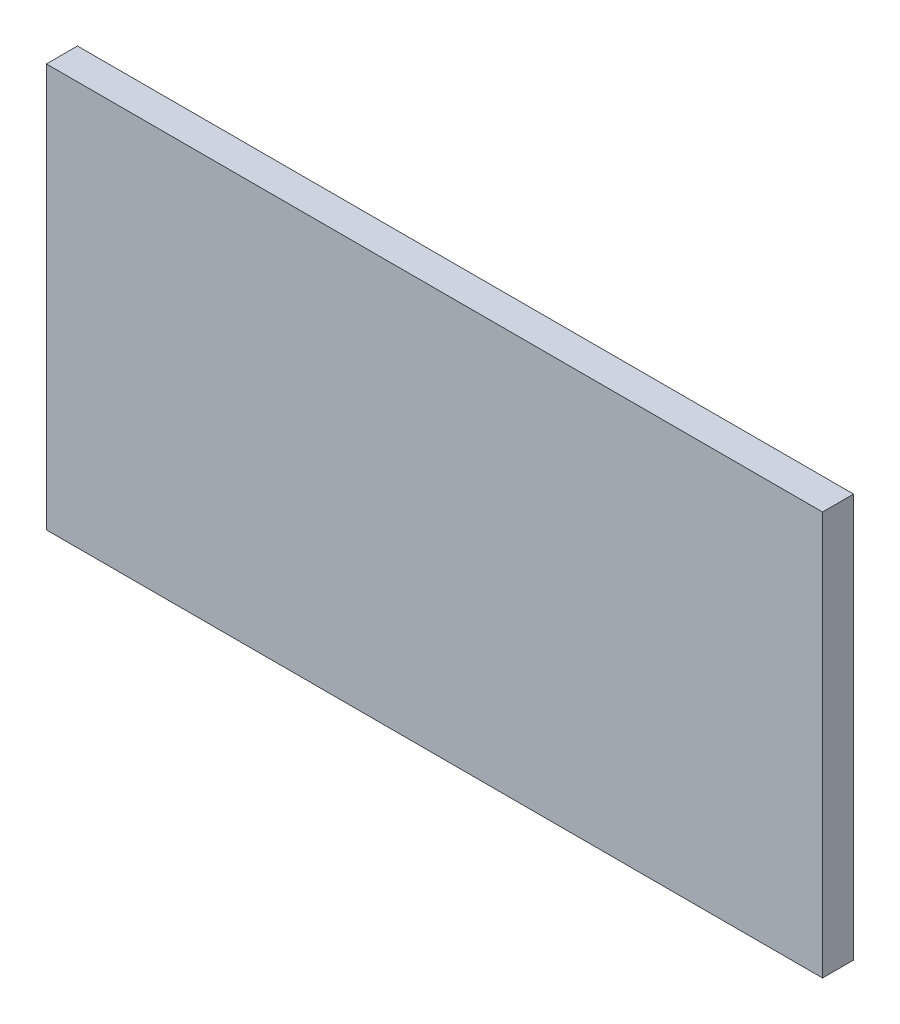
ISO-10303-21;
HEADER;
FILE_DESCRIPTION(('STEP AP214'),'2;1');
FILE_NAME('part.step','',(''),(''),'','','');
FILE_SCHEMA(('AUTOMOTIVE_DESIGN { 1 0 10303 214 1 1 1 1 }'));
ENDSEC;
DATA;
#1=APPLICATION_CONTEXT('core data for automotive mechanical design processes');
#2=APPLICATION_PROTOCOL_DEFINITION('international standard','automotive_design',2000,#1);
#3=PRODUCT_CONTEXT('',#1,'mechanical');
#4=PRODUCT('Part','Part','',(#3));
#5=PRODUCT_RELATED_PRODUCT_CATEGORY('part','',(#4));
#6=PRODUCT_DEFINITION_FORMATION('','',#4);
#7=PRODUCT_DEFINITION_CONTEXT('part definition',#1,'design');
#8=PRODUCT_DEFINITION('design','',#6,#7);
#9=PRODUCT_DEFINITION_SHAPE('','',#8);
#10=(LENGTH_UNIT() NAMED_UNIT(*) SI_UNIT(.MILLI.,.METRE.));
#11=(NAMED_UNIT(*) PLANE_ANGLE_UNIT() SI_UNIT($,.RADIAN.));
#12=(NAMED_UNIT(*) SI_UNIT($,.STERADIAN.) SOLID_ANGLE_UNIT());
#13=UNCERTAINTY_MEASURE_WITH_UNIT(LENGTH_MEASURE(1.E-05),#10,'distance_accuracy_value','');
#14=(GEOMETRIC_REPRESENTATION_CONTEXT(3) GLOBAL_UNCERTAINTY_ASSIGNED_CONTEXT((#13)) GLOBAL_UNIT_ASSIGNED_CONTEXT((#10,
#11,#12)) REPRESENTATION_CONTEXT('',''));
#15=CARTESIAN_POINT('',(0.,0.,0.));
#16=DIRECTION('',(0.,0.,1.));
#17=DIRECTION('',(1.,0.,0.));
#18=AXIS2_PLACEMENT_3D('',#15,#16,#17);
#19=CARTESIAN_POINT('',(0.,0.,101.6));
#20=DIRECTION('',(1.,0.,0.));
#21=DIRECTION('',(0.,1.,0.));
#22=AXIS2_PLACEMENT_3D('',#19,#20,#21);
#23=PLANE('',#22);
#24=DIRECTION('',(0.,-1.,0.));
#25=VECTOR('',#24,1.);
#26=CARTESIAN_POINT('',(0.,0.,0.));
#27=LINE('',#26,#25);
#28=CARTESIAN_POINT('',(-4.44089209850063E-13,1320.8,0.));
#29=VERTEX_POINT('',#28);
#30=CARTESIAN_POINT('',(0.,0.,0.));
#31=VERTEX_POINT('',#30);
#32=EDGE_CURVE('E93',#29,#31,#27,.T.);
#33=ORIENTED_EDGE('',*,*,#32,.T.);
#34=DIRECTION('',(0.,0.,-1.));
#35=VECTOR('',#34,1.);
#36=CARTESIAN_POINT('',(0.,0.,101.6));
#37=LINE('',#36,#35);
#38=CARTESIAN_POINT('',(0.,0.,101.6));
#39=VERTEX_POINT('',#38);
#40=EDGE_CURVE('E11',#39,#31,#37,.T.);
#41=ORIENTED_EDGE('',*,*,#40,.F.);
#42=DIRECTION('',(0.,-1.,0.));
#43=VECTOR('',#42,1.);
#44=CARTESIAN_POINT('',(0.,0.,101.6));
#45=LINE('',#44,#43);
#46=CARTESIAN_POINT('',(-4.44089209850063E-13,1320.8,101.6));
#47=VERTEX_POINT('',#46);
#48=EDGE_CURVE('E81',#47,#39,#45,.T.);
#49=ORIENTED_EDGE('',*,*,#48,.F.);
#50=DIRECTION('',(0.,0.,-1.));
#51=VECTOR('',#50,1.);
#52=CARTESIAN_POINT('',(-4.44089209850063E-13,1320.8,101.6));
#53=LINE('',#52,#51);
#54=EDGE_CURVE('E89',#47,#29,#53,.T.);
#55=ORIENTED_EDGE('',*,*,#54,.T.);
#56=EDGE_LOOP('',(#33,#41,#49,#55));
#57=FACE_BOUND('',#56,.T.);
#58=ADVANCED_FACE('F30',(#57),#23,.F.);
#59=CARTESIAN_POINT('',(0.,0.,101.6));
#60=DIRECTION('',(0.,1.,0.));
#61=DIRECTION('',(0.,0.,1.));
#62=AXIS2_PLACEMENT_3D('',#59,#60,#61);
#63=PLANE('',#62);
#64=DIRECTION('',(1.,0.,0.));
#65=VECTOR('',#64,1.);
#66=CARTESIAN_POINT('',(0.,0.,0.));
#67=LINE('',#66,#65);
#68=CARTESIAN_POINT('',(2540.,0.,0.));
#69=VERTEX_POINT('',#68);
#70=EDGE_CURVE('E85',#31,#69,#67,.T.);
#71=ORIENTED_EDGE('',*,*,#70,.T.);
#72=DIRECTION('',(0.,0.,-1.));
#73=VECTOR('',#72,1.);
#74=CARTESIAN_POINT('',(2540.,0.,101.6));
#75=LINE('',#74,#73);
#76=CARTESIAN_POINT('',(2540.,0.,101.6));
#77=VERTEX_POINT('',#76);
#78=EDGE_CURVE('E38',#77,#69,#75,.T.);
#79=ORIENTED_EDGE('',*,*,#78,.F.);
#80=DIRECTION('',(1.,0.,0.));
#81=VECTOR('',#80,1.);
#82=CARTESIAN_POINT('',(0.,0.,101.6));
#83=LINE('',#82,#81);
#84=EDGE_CURVE('E76',#39,#77,#83,.T.);
#85=ORIENTED_EDGE('',*,*,#84,.F.);
#86=ORIENTED_EDGE('',*,*,#40,.T.);
#87=EDGE_LOOP('',(#71,#79,#85,#86));
#88=FACE_BOUND('',#87,.T.);
#89=ADVANCED_FACE('F84',(#88),#63,.F.);
#90=CARTESIAN_POINT('',(2540.,0.,101.6));
#91=DIRECTION('',(-1.,0.,0.));
#92=DIRECTION('',(0.,-1.,0.));
#93=AXIS2_PLACEMENT_3D('',#90,#91,#92);
#94=PLANE('',#93);
#95=DIRECTION('',(0.,1.,0.));
#96=VECTOR('',#95,1.);
#97=CARTESIAN_POINT('',(2540.,0.,0.));
#98=LINE('',#97,#96);
#99=CARTESIAN_POINT('',(2540.,1320.8,0.));
#100=VERTEX_POINT('',#99);
#101=EDGE_CURVE('E63',#69,#100,#98,.T.);
#102=ORIENTED_EDGE('',*,*,#101,.T.);
#103=DIRECTION('',(0.,0.,-1.));
#104=VECTOR('',#103,1.);
#105=CARTESIAN_POINT('',(2540.,1320.8,101.6));
#106=LINE('',#105,#104);
#107=CARTESIAN_POINT('',(2540.,1320.8,101.6));
#108=VERTEX_POINT('',#107);
#109=EDGE_CURVE('E86',#108,#100,#106,.T.);
#110=ORIENTED_EDGE('',*,*,#109,.F.);
#111=DIRECTION('',(0.,1.,0.));
#112=VECTOR('',#111,1.);
#113=CARTESIAN_POINT('',(2540.,0.,101.6));
#114=LINE('',#113,#112);
#115=EDGE_CURVE('E79',#77,#108,#114,.T.);
#116=ORIENTED_EDGE('',*,*,#115,.F.);
#117=ORIENTED_EDGE('',*,*,#78,.T.);
#118=EDGE_LOOP('',(#102,#110,#116,#117));
#119=FACE_BOUND('',#118,.T.);
#120=ADVANCED_FACE('F87',(#119),#94,.F.);
#121=CARTESIAN_POINT('',(-4.44089209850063E-13,1320.8,101.6));
#122=DIRECTION('',(0.,-1.,0.));
#123=DIRECTION('',(0.,0.,-1.));
#124=AXIS2_PLACEMENT_3D('',#121,#122,#123);
#125=PLANE('',#124);
#126=DIRECTION('',(-1.,0.,0.));
#127=VECTOR('',#126,1.);
#128=CARTESIAN_POINT('',(-4.44089209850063E-13,1320.8,0.));
#129=LINE('',#128,#127);
#130=EDGE_CURVE('E69',#100,#29,#129,.T.);
#131=ORIENTED_EDGE('',*,*,#130,.T.);
#132=ORIENTED_EDGE('',*,*,#54,.F.);
#133=DIRECTION('',(-1.,0.,0.));
#134=VECTOR('',#133,1.);
#135=CARTESIAN_POINT('',(-4.44089209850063E-13,1320.8,101.6));
#136=LINE('',#135,#134);
#137=EDGE_CURVE('E46',#108,#47,#136,.T.);
#138=ORIENTED_EDGE('',*,*,#137,.F.);
#139=ORIENTED_EDGE('',*,*,#109,.T.);
#140=EDGE_LOOP('',(#131,#132,#138,#139));
#141=FACE_BOUND('',#140,.T.);
#142=ADVANCED_FACE('F100',(#141),#125,.F.);
#143=CARTESIAN_POINT('',(0.,0.,101.6));
#144=DIRECTION('',(0.,0.,-1.));
#145=DIRECTION('',(-1.,0.,0.));
#146=AXIS2_PLACEMENT_3D('',#143,#144,#145);
#147=PLANE('',#146);
#148=ORIENTED_EDGE('',*,*,#48,.T.);
#149=ORIENTED_EDGE('',*,*,#84,.T.);
#150=ORIENTED_EDGE('',*,*,#115,.T.);
#151=ORIENTED_EDGE('',*,*,#137,.T.);
#152=EDGE_LOOP('',(#148,#149,#150,#151));
#153=FACE_BOUND('',#152,.T.);
#154=ADVANCED_FACE('F77',(#153),#147,.F.);
#155=CARTESIAN_POINT('',(0.,0.,0.));
#156=DIRECTION('',(0.,0.,-1.));
#157=DIRECTION('',(-1.,0.,0.));
#158=AXIS2_PLACEMENT_3D('',#155,#156,#157);
#159=PLANE('',#158);
#160=ORIENTED_EDGE('',*,*,#32,.F.);
#161=ORIENTED_EDGE('',*,*,#130,.F.);
#162=ORIENTED_EDGE('',*,*,#101,.F.);
#163=ORIENTED_EDGE('',*,*,#70,.F.);
#164=EDGE_LOOP('',(#160,#161,#162,#163));
#165=FACE_BOUND('',#164,.T.);
#166=ADVANCED_FACE('F103',(#165),#159,.T.);
#167=CLOSED_SHELL('',(#58,#89,#120,#142,#154,#166));
#168=MANIFOLD_SOLID_BREP('B2',#167);
#169=ADVANCED_BREP_SHAPE_REPRESENTATION('',(#18,#168),#14);
#170=SHAPE_DEFINITION_REPRESENTATION(#9,#169);
ENDSEC;
END-ISO-10303-21;
